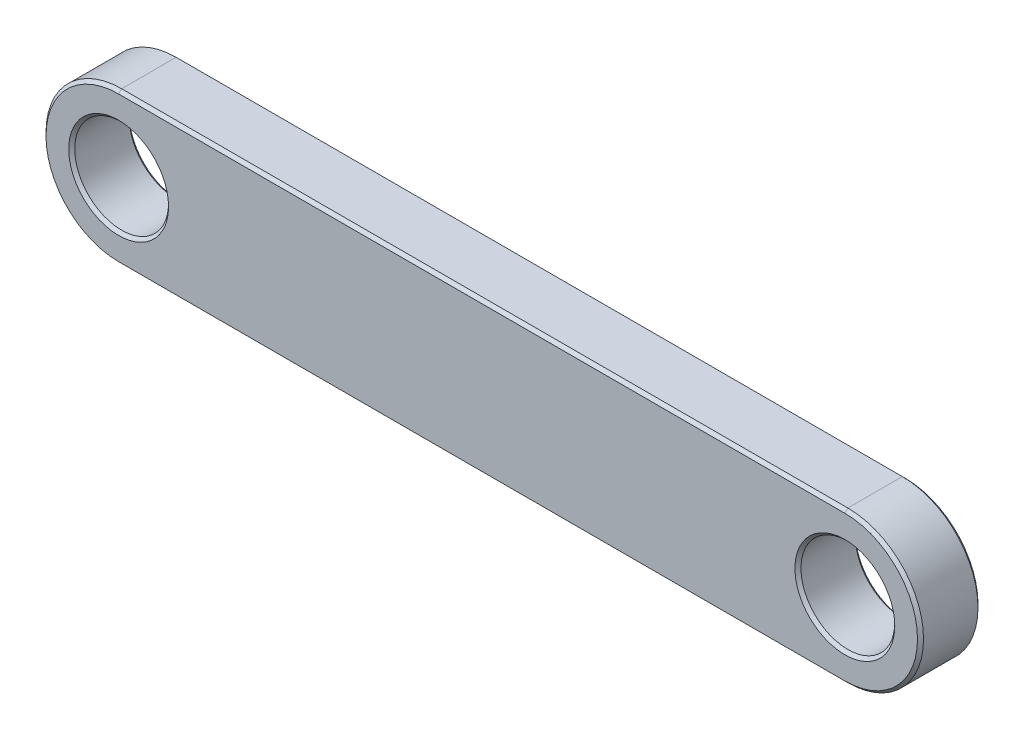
from build123d import *

# Parameters (mm, degrees)
SKETCH1_R           = 1.55
BOSS_EXTRUDE1_DEPTH = 2
CHAMFER1_SIZE       = 0.1


with BuildPart() as part:
    # Sketch1 → Boss-Extrude1 (new body)
    with BuildSketch(Plane.XY):
        with BuildLine():
            Line((12, -2.5), (-12, -2.5))
            ThreePointArc((-12, -2.5), (-14.5, 0), (-12, 2.5))
            Line((-12, 2.5), (12, 2.5))
            ThreePointArc((12, 2.5), (14.5, 0), (12, -2.5))
        make_face()
        with Locations((-12, 0)):
            Circle(SKETCH1_R, mode=Mode.SUBTRACT)
        with Locations((12, 0)):
            Circle(SKETCH1_R, mode=Mode.SUBTRACT)
    extrude(amount=BOSS_EXTRUDE1_DEPTH)

    # Chamfer1
    chamfer1_edges = [part.edges().sort_by_distance(p)[0] for p in [
        (-13.55, 0, 0),
        (-13.55, 0, 2),
        (-14.5, 0, 2),
        (10.45, 0, 0),
        (10.45, 0, 2),
        (0, -2.5, 2),
        (14.5, 0, 2),
        (0, -2.5, 0),
        (-14.5, 0, 0),
        (0, 2.5, 0),
        (14.5, 0, 0),
        (0, 2.5, 2),
    ]]
    chamfer(chamfer1_edges, length=CHAMFER1_SIZE)


solid = part.part
